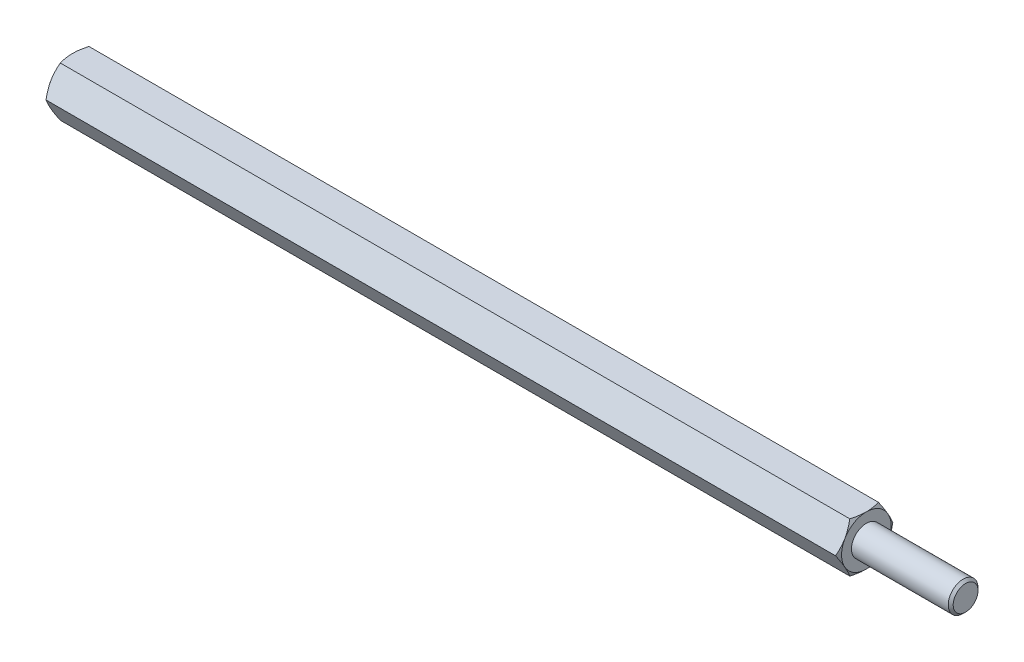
ISO-10303-21;
HEADER;
FILE_DESCRIPTION(('STEP AP214'),'2;1');
FILE_NAME('part.step','',(''),(''),'','','');
FILE_SCHEMA(('AUTOMOTIVE_DESIGN { 1 0 10303 214 1 1 1 1 }'));
ENDSEC;
DATA;
#1=APPLICATION_CONTEXT('core data for automotive mechanical design processes');
#2=APPLICATION_PROTOCOL_DEFINITION('international standard','automotive_design',2000,#1);
#3=PRODUCT_CONTEXT('',#1,'mechanical');
#4=PRODUCT('Part','Part','',(#3));
#5=PRODUCT_RELATED_PRODUCT_CATEGORY('part','',(#4));
#6=PRODUCT_DEFINITION_FORMATION('','',#4);
#7=PRODUCT_DEFINITION_CONTEXT('part definition',#1,'design');
#8=PRODUCT_DEFINITION('design','',#6,#7);
#9=PRODUCT_DEFINITION_SHAPE('','',#8);
#10=(LENGTH_UNIT() NAMED_UNIT(*) SI_UNIT(.MILLI.,.METRE.));
#11=(NAMED_UNIT(*) PLANE_ANGLE_UNIT() SI_UNIT($,.RADIAN.));
#12=(NAMED_UNIT(*) SI_UNIT($,.STERADIAN.) SOLID_ANGLE_UNIT());
#13=UNCERTAINTY_MEASURE_WITH_UNIT(LENGTH_MEASURE(1.E-05),#10,'distance_accuracy_value','');
#14=(GEOMETRIC_REPRESENTATION_CONTEXT(3) GLOBAL_UNCERTAINTY_ASSIGNED_CONTEXT((#13)) GLOBAL_UNIT_ASSIGNED_CONTEXT((#10,
#11,#12)) REPRESENTATION_CONTEXT('',''));
#15=CARTESIAN_POINT('',(0.,0.,0.));
#16=DIRECTION('',(0.,0.,1.));
#17=DIRECTION('',(1.,0.,0.));
#18=AXIS2_PLACEMENT_3D('',#15,#16,#17);
#19=CARTESIAN_POINT('',(40.,2.5,-1.44337567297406));
#20=DIRECTION('',(1.,0.,0.));
#21=DIRECTION('',(0.,0.,-1.));
#22=AXIS2_PLACEMENT_3D('',#19,#20,#21);
#23=PLANE('',#22);
#24=CARTESIAN_POINT('',(40.,0.,0.));
#25=DIRECTION('',(1.,0.,0.));
#26=DIRECTION('',(0.,0.,-1.));
#27=AXIS2_PLACEMENT_3D('',#24,#25,#26);
#28=CIRCLE('',#27,2.50000000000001);
#29=CARTESIAN_POINT('',(40.,-1.25000000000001,-2.16506350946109));
#30=VERTEX_POINT('',#29);
#31=CARTESIAN_POINT('',(40.,1.25,-2.1650635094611));
#32=VERTEX_POINT('',#31);
#33=EDGE_CURVE('E288',#30,#32,#28,.T.);
#34=ORIENTED_EDGE('',*,*,#33,.T.);
#35=CARTESIAN_POINT('',(40.,2.5,0.));
#36=VERTEX_POINT('',#35);
#37=EDGE_CURVE('E53',#32,#36,#28,.T.);
#38=ORIENTED_EDGE('',*,*,#37,.T.);
#39=CARTESIAN_POINT('',(40.,1.25,2.1650635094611));
#40=VERTEX_POINT('',#39);
#41=EDGE_CURVE('E297',#36,#40,#28,.T.);
#42=ORIENTED_EDGE('',*,*,#41,.T.);
#43=CARTESIAN_POINT('',(40.,-1.25000000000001,2.1650635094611));
#44=VERTEX_POINT('',#43);
#45=EDGE_CURVE('E301',#40,#44,#28,.T.);
#46=ORIENTED_EDGE('',*,*,#45,.T.);
#47=CARTESIAN_POINT('',(40.,0.,0.));
#48=DIRECTION('',(-1.,0.,0.));
#49=DIRECTION('',(0.,-1.,0.));
#50=AXIS2_PLACEMENT_3D('',#47,#48,#49);
#51=CIRCLE('',#50,2.50000000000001);
#52=CARTESIAN_POINT('',(40.,-2.50000000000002,0.));
#53=VERTEX_POINT('',#52);
#54=EDGE_CURVE('E193',#53,#44,#51,.T.);
#55=ORIENTED_EDGE('',*,*,#54,.F.);
#56=EDGE_CURVE('E61',#53,#30,#28,.T.);
#57=ORIENTED_EDGE('',*,*,#56,.T.);
#58=EDGE_LOOP('',(#34,#38,#42,#46,#55,#57));
#59=FACE_BOUND('',#58,.T.);
#60=CARTESIAN_POINT('',(40.,0.,0.));
#61=DIRECTION('',(1.,0.,0.));
#62=DIRECTION('',(0.,0.,-1.));
#63=AXIS2_PLACEMENT_3D('',#60,#61,#62);
#64=CIRCLE('',#63,1.5);
#65=CARTESIAN_POINT('',(40.,0.,-1.5));
#66=VERTEX_POINT('',#65);
#67=EDGE_CURVE('E313',#66,#66,#64,.T.);
#68=ORIENTED_EDGE('',*,*,#67,.F.);
#69=EDGE_LOOP('',(#68));
#70=FACE_BOUND('',#69,.T.);
#71=ADVANCED_FACE('F37',(#59,#70),#23,.T.);
#72=CARTESIAN_POINT('',(40.,0.,-2.88675134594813));
#73=DIRECTION('',(0.,-0.5,0.866025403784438));
#74=DIRECTION('',(0.,-0.866025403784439,-0.5));
#75=AXIS2_PLACEMENT_3D('',#72,#73,#74);
#76=PLANE('',#75);
#77=CARTESIAN_POINT('',(39.7766423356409,-0.000200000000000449,-2.88686681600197));
#78=CARTESIAN_POINT('',(39.8132783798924,0.10966323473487,-2.82343724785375));
#79=CARTESIAN_POINT('',(39.846597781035,0.220474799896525,-2.75946016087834));
#80=CARTESIAN_POINT('',(39.9047577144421,0.444016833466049,-2.63039810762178));
#81=CARTESIAN_POINT('',(39.9295776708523,0.556751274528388,-2.5653108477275));
#82=CARTESIAN_POINT('',(39.968214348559,0.780822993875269,-2.43594298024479));
#83=CARTESIAN_POINT('',(39.9822882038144,0.892125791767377,-2.37168227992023));
#84=CARTESIAN_POINT('',(39.9990908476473,1.11525522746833,-2.24285844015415));
#85=CARTESIAN_POINT('',(40.0018335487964,1.22708105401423,-2.17829576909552));
#86=CARTESIAN_POINT('',(39.996134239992,1.43604197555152,-2.05765212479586));
#87=CARTESIAN_POINT('',(39.9890916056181,1.53320831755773,-2.0015531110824));
#88=CARTESIAN_POINT('',(39.9667685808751,1.726907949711,-1.88972057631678));
#89=CARTESIAN_POINT('',(39.9514805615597,1.82344056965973,-1.8339874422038));
#90=CARTESIAN_POINT('',(39.9132609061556,2.01753972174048,-1.7219242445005));
#91=CARTESIAN_POINT('',(39.8901672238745,2.11508168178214,-1.66560836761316));
#92=CARTESIAN_POINT('',(39.8377533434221,2.30871060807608,-1.55381665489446));
#93=CARTESIAN_POINT('',(39.8084454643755,2.40480005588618,-1.49833938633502));
#94=CARTESIAN_POINT('',(39.7766423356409,2.5002,-1.44326020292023));
#95=B_SPLINE_CURVE_WITH_KNOTS('',3,(#77,#78,#79,#80,#81,#82,#83,#84,#85,#86,#87,#88,#89,#90,#91,
#92,#93,#94),.UNSPECIFIED.,.F.,.F.,(4,2,2,2,2,2,2,2,4),(0.,0.396285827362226,0.793524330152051,
1.18093086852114,1.56786160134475,1.90479741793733,2.24204551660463,2.58677531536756,
2.93082800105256),.UNSPECIFIED.);
#96=CARTESIAN_POINT('',(39.7767090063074,0.,-2.88675134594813));
#97=VERTEX_POINT('',#96);
#98=EDGE_CURVE('E353',#97,#32,#95,.T.);
#99=ORIENTED_EDGE('',*,*,#98,.F.);
#100=DIRECTION('',(-1.,0.,0.));
#101=VECTOR('',#100,1.);
#102=CARTESIAN_POINT('',(40.,0.,-2.88675134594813));
#103=LINE('',#102,#101);
#104=CARTESIAN_POINT('',(-39.7767090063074,0.,-2.88675134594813));
#105=VERTEX_POINT('',#104);
#106=EDGE_CURVE('E264',#97,#105,#103,.T.);
#107=ORIENTED_EDGE('',*,*,#106,.T.);
#108=CARTESIAN_POINT('',(-39.7766423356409,2.5002,-1.44326020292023));
#109=CARTESIAN_POINT('',(-39.8132783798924,2.39033676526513,-1.50668977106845));
#110=CARTESIAN_POINT('',(-39.846597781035,2.27952520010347,-1.57066685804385));
#111=CARTESIAN_POINT('',(-39.9047577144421,2.05598316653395,-1.69972891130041));
#112=CARTESIAN_POINT('',(-39.9295776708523,1.94324872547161,-1.7648161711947));
#113=CARTESIAN_POINT('',(-39.968214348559,1.71917700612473,-1.8941840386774));
#114=CARTESIAN_POINT('',(-39.9822882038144,1.60787420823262,-1.95844473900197));
#115=CARTESIAN_POINT('',(-39.9990908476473,1.38474477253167,-2.08726857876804));
#116=CARTESIAN_POINT('',(-40.0018335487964,1.27291894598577,-2.15183124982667));
#117=CARTESIAN_POINT('',(-39.996134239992,1.06395802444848,-2.27247489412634));
#118=CARTESIAN_POINT('',(-39.9890916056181,0.966791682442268,-2.32857390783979));
#119=CARTESIAN_POINT('',(-39.9667685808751,0.773092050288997,-2.44040644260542));
#120=CARTESIAN_POINT('',(-39.9514805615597,0.676559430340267,-2.4961395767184));
#121=CARTESIAN_POINT('',(-39.9132609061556,0.482460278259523,-2.60820277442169));
#122=CARTESIAN_POINT('',(-39.8901672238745,0.384918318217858,-2.66451865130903));
#123=CARTESIAN_POINT('',(-39.8377533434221,0.191289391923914,-2.77631036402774));
#124=CARTESIAN_POINT('',(-39.8084454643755,0.095199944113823,-2.83178763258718));
#125=CARTESIAN_POINT('',(-39.7766423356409,-0.000200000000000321,-2.88686681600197));
#126=B_SPLINE_CURVE_WITH_KNOTS('',3,(#108,#109,#110,#111,#112,#113,#114,#115,#116,#117,#118,
#119,#120,#121,#122,#123,#124,#125),.UNSPECIFIED.,.F.,.F.,(4,2,2,2,2,2,2,2,4),(0.,
0.396285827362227,0.793524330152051,1.18093086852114,1.56786160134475,1.90479741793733,
2.24204551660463,2.58677531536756,2.93082800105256),.UNSPECIFIED.);
#127=CARTESIAN_POINT('',(-40.,1.25,-2.1650635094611));
#128=VERTEX_POINT('',#127);
#129=EDGE_CURVE('E341',#128,#105,#126,.T.);
#130=ORIENTED_EDGE('',*,*,#129,.F.);
#131=CARTESIAN_POINT('',(-39.7767090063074,2.5,-1.44337567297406));
#132=VERTEX_POINT('',#131);
#133=EDGE_CURVE('E393',#132,#128,#126,.T.);
#134=ORIENTED_EDGE('',*,*,#133,.F.);
#135=DIRECTION('',(-1.,0.,0.));
#136=VECTOR('',#135,1.);
#137=CARTESIAN_POINT('',(40.,2.5,-1.44337567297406));
#138=LINE('',#137,#136);
#139=CARTESIAN_POINT('',(39.7767090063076,2.5,-1.44337567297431));
#140=VERTEX_POINT('',#139);
#141=EDGE_CURVE('E279',#140,#132,#138,.T.);
#142=ORIENTED_EDGE('',*,*,#141,.F.);
#143=EDGE_CURVE('E229',#32,#140,#95,.T.);
#144=ORIENTED_EDGE('',*,*,#143,.F.);
#145=EDGE_LOOP('',(#99,#107,#130,#134,#142,#144));
#146=FACE_BOUND('',#145,.T.);
#147=ADVANCED_FACE('F148',(#146),#76,.F.);
#148=CARTESIAN_POINT('',(40.,2.5,-1.44337567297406));
#149=DIRECTION('',(0.,-1.,0.));
#150=DIRECTION('',(0.,0.,-1.));
#151=AXIS2_PLACEMENT_3D('',#148,#149,#150);
#152=PLANE('',#151);
#153=CARTESIAN_POINT('',(38.7680338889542,2.5,-3.90158441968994));
#154=CARTESIAN_POINT('',(38.8212077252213,2.5,-3.79217004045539));
#155=CARTESIAN_POINT('',(38.8738786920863,2.5,-3.68250707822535));
#156=CARTESIAN_POINT('',(38.9779324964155,2.5,-3.46255185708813));
#157=CARTESIAN_POINT('',(39.0293151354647,2.5,-3.35225950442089));
#158=CARTESIAN_POINT('',(39.1307630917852,2.5,-3.13035696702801));
#159=CARTESIAN_POINT('',(39.1808199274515,2.5,-3.0187428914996));
#160=CARTESIAN_POINT('',(39.2789171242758,2.5,-2.79463535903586));
#161=CARTESIAN_POINT('',(39.3269575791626,2.5,-2.6821419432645));
#162=CARTESIAN_POINT('',(39.4220184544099,2.5,-2.45240385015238));
#163=CARTESIAN_POINT('',(39.4689543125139,2.5,-2.33512399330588));
#164=CARTESIAN_POINT('',(39.5593326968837,2.5,-2.09920133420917));
#165=CARTESIAN_POINT('',(39.6027748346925,2.5,-1.98055838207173));
#166=CARTESIAN_POINT('',(39.6850435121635,2.5,-1.74193489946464));
#167=CARTESIAN_POINT('',(39.7238791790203,2.5,-1.62195754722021));
#168=CARTESIAN_POINT('',(39.7957050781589,2.5,-1.38028205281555));
#169=CARTESIAN_POINT('',(39.8286971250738,2.5,-1.25858445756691));
#170=CARTESIAN_POINT('',(39.8870959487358,2.5,-1.01406369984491));
#171=CARTESIAN_POINT('',(39.9125437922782,2.5,-0.891250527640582));
#172=CARTESIAN_POINT('',(39.9544275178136,2.5,-0.64407172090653));
#173=CARTESIAN_POINT('',(39.9708643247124,2.5,-0.519706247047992));
#174=CARTESIAN_POINT('',(39.9932006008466,2.5,-0.271679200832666));
#175=CARTESIAN_POINT('',(39.9992375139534,2.5,-0.148030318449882));
#176=CARTESIAN_POINT('',(40.0006256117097,2.5,0.099339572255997));
#177=CARTESIAN_POINT('',(39.9959765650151,2.5,0.223060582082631));
#178=CARTESIAN_POINT('',(39.9794044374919,2.5,0.432351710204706));
#179=CARTESIAN_POINT('',(39.9701066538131,2.5,0.518143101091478));
#180=CARTESIAN_POINT('',(39.9469384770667,2.5,0.689112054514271));
#181=CARTESIAN_POINT('',(39.9330674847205,2.5,0.774289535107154));
#182=CARTESIAN_POINT('',(39.8853202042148,2.5,1.02876599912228));
#183=CARTESIAN_POINT('',(39.8453176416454,2.5,1.19691958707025));
#184=CARTESIAN_POINT('',(39.7522656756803,2.5,1.53362893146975));
#185=CARTESIAN_POINT('',(39.6989362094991,2.5,1.70210423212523));
#186=CARTESIAN_POINT('',(39.6123716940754,2.5,1.95247339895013));
#187=CARTESIAN_POINT('',(39.5824247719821,2.5,2.0355318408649));
#188=CARTESIAN_POINT('',(39.5206840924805,2.5,2.20095860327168));
#189=CARTESIAN_POINT('',(39.4888903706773,2.5,2.28332693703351));
#190=CARTESIAN_POINT('',(39.404014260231,2.5,2.49723312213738));
#191=CARTESIAN_POINT('',(39.3497173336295,2.5,2.62828796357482));
#192=CARTESIAN_POINT('',(39.2381273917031,2.5,2.88912034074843));
#193=CARTESIAN_POINT('',(39.1808341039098,2.5,3.01889775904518));
#194=CARTESIAN_POINT('',(39.0639348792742,2.5,3.27745045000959));
#195=CARTESIAN_POINT('',(39.004328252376,2.5,3.40622540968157));
#196=CARTESIAN_POINT('',(38.8833234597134,2.5,3.6629323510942));
#197=CARTESIAN_POINT('',(38.821925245,2.5,3.79086430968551));
#198=CARTESIAN_POINT('',(38.6354580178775,2.5,4.17399495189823));
#199=CARTESIAN_POINT('',(38.5082824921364,2.5,4.42816724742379));
#200=CARTESIAN_POINT('',(38.2503455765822,2.5,4.93461464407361));
#201=CARTESIAN_POINT('',(38.1195848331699,2.5,5.18689007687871));
#202=CARTESIAN_POINT('',(37.8687100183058,2.5,5.6651245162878));
#203=CARTESIAN_POINT('',(37.7488298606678,2.5,5.89120644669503));
#204=CARTESIAN_POINT('',(37.5075902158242,2.5,6.34259369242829));
#205=CARTESIAN_POINT('',(37.3862306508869,2.5,6.56789896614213));
#206=CARTESIAN_POINT('',(37.142780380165,2.5,7.01722044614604));
#207=CARTESIAN_POINT('',(37.0206930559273,2.5,7.2412384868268));
#208=CARTESIAN_POINT('',(36.7756662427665,2.5,7.68878772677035));
#209=CARTESIAN_POINT('',(36.652726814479,2.5,7.91231895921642));
#210=CARTESIAN_POINT('',(36.5294756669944,2.5,8.13567697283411));
#211=B_SPLINE_CURVE_WITH_KNOTS('',3,(#153,#154,#155,#156,#157,#158,#159,#160,#161,#162,#163,
#164,#165,#166,#167,#168,#169,#170,#171,#172,#173,#174,#175,#176,#177,#178,#179,#180,#181,#182,
#183,#184,#185,#186,#187,#188,#189,#190,#191,#192,#193,#194,#195,#196,#197,#198,#199,#200,#201,
#202,#203,#204,#205,#206,#207,#208,#209,#210),.UNSPECIFIED.,.F.,.F.,(4,2,2,2,2,2,2,2,2,2,2,2,2,
2,2,2,2,2,2,2,2,2,2,2,2,2,2,2,4),(0.,0.364957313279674,0.729970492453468,1.09692930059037,
1.46387103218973,1.84279746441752,2.22176597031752,2.59997058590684,2.97805755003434,
3.3540469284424,3.72999770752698,4.1009407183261,4.47189175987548,4.73064905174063,
4.98944026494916,5.50729076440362,6.03710483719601,6.30196454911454,6.56681915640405,
6.99233818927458,7.41789598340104,7.84358170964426,8.26927907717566,9.12186602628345,
9.97430025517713,10.7419897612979,11.509719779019,12.2750964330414,13.0404191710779),.UNSPECIFIED.);
#212=EDGE_CURVE('E227',#140,#36,#211,.T.);
#213=ORIENTED_EDGE('',*,*,#212,.F.);
#214=ORIENTED_EDGE('',*,*,#141,.T.);
#215=CARTESIAN_POINT('',(-38.7680338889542,2.5,-3.90158441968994));
#216=CARTESIAN_POINT('',(-38.8212077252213,2.5,-3.79217004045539));
#217=CARTESIAN_POINT('',(-38.8738786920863,2.5,-3.68250707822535));
#218=CARTESIAN_POINT('',(-38.9779324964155,2.5,-3.46255185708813));
#219=CARTESIAN_POINT('',(-39.0293151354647,2.5,-3.35225950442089));
#220=CARTESIAN_POINT('',(-39.1307630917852,2.5,-3.13035696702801));
#221=CARTESIAN_POINT('',(-39.1808199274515,2.5,-3.0187428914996));
#222=CARTESIAN_POINT('',(-39.2789171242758,2.5,-2.79463535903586));
#223=CARTESIAN_POINT('',(-39.3269575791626,2.5,-2.6821419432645));
#224=CARTESIAN_POINT('',(-39.4220184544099,2.5,-2.45240385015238));
#225=CARTESIAN_POINT('',(-39.4689543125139,2.5,-2.33512399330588));
#226=CARTESIAN_POINT('',(-39.5593326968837,2.5,-2.09920133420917));
#227=CARTESIAN_POINT('',(-39.6027748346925,2.5,-1.98055838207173));
#228=CARTESIAN_POINT('',(-39.6850435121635,2.5,-1.74193489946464));
#229=CARTESIAN_POINT('',(-39.7238791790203,2.5,-1.62195754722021));
#230=CARTESIAN_POINT('',(-39.7957050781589,2.5,-1.38028205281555));
#231=CARTESIAN_POINT('',(-39.8286971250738,2.5,-1.25858445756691));
#232=CARTESIAN_POINT('',(-39.8870959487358,2.5,-1.01406369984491));
#233=CARTESIAN_POINT('',(-39.9125437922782,2.5,-0.891250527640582));
#234=CARTESIAN_POINT('',(-39.9544275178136,2.5,-0.64407172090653));
#235=CARTESIAN_POINT('',(-39.9708643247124,2.5,-0.519706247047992));
#236=CARTESIAN_POINT('',(-39.9932006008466,2.5,-0.271679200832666));
#237=CARTESIAN_POINT('',(-39.9992375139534,2.5,-0.148030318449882));
#238=CARTESIAN_POINT('',(-40.0006256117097,2.5,0.099339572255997));
#239=CARTESIAN_POINT('',(-39.9959765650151,2.5,0.223060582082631));
#240=CARTESIAN_POINT('',(-39.9794044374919,2.5,0.432351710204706));
#241=CARTESIAN_POINT('',(-39.9701066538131,2.5,0.518143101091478));
#242=CARTESIAN_POINT('',(-39.9469384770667,2.5,0.689112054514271));
#243=CARTESIAN_POINT('',(-39.9330674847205,2.5,0.774289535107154));
#244=CARTESIAN_POINT('',(-39.8853202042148,2.5,1.02876599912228));
#245=CARTESIAN_POINT('',(-39.8453176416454,2.5,1.19691958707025));
#246=CARTESIAN_POINT('',(-39.7522656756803,2.5,1.53362893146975));
#247=CARTESIAN_POINT('',(-39.6989362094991,2.5,1.70210423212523));
#248=CARTESIAN_POINT('',(-39.6123716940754,2.5,1.95247339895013));
#249=CARTESIAN_POINT('',(-39.5824247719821,2.5,2.0355318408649));
#250=CARTESIAN_POINT('',(-39.5206840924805,2.5,2.20095860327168));
#251=CARTESIAN_POINT('',(-39.4888903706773,2.5,2.28332693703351));
#252=CARTESIAN_POINT('',(-39.404014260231,2.5,2.49723312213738));
#253=CARTESIAN_POINT('',(-39.3497173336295,2.5,2.62828796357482));
#254=CARTESIAN_POINT('',(-39.2381273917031,2.5,2.88912034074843));
#255=CARTESIAN_POINT('',(-39.1808341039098,2.5,3.01889775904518));
#256=CARTESIAN_POINT('',(-39.0639348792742,2.5,3.27745045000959));
#257=CARTESIAN_POINT('',(-39.004328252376,2.5,3.40622540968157));
#258=CARTESIAN_POINT('',(-38.8833234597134,2.5,3.6629323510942));
#259=CARTESIAN_POINT('',(-38.821925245,2.5,3.79086430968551));
#260=CARTESIAN_POINT('',(-38.6354580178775,2.5,4.17399495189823));
#261=CARTESIAN_POINT('',(-38.5082824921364,2.5,4.42816724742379));
#262=CARTESIAN_POINT('',(-38.2503455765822,2.5,4.93461464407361));
#263=CARTESIAN_POINT('',(-38.1195848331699,2.5,5.18689007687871));
#264=CARTESIAN_POINT('',(-37.8687100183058,2.5,5.6651245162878));
#265=CARTESIAN_POINT('',(-37.7488298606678,2.5,5.89120644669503));
#266=CARTESIAN_POINT('',(-37.5075902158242,2.5,6.34259369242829));
#267=CARTESIAN_POINT('',(-37.3862306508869,2.5,6.56789896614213));
#268=CARTESIAN_POINT('',(-37.142780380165,2.5,7.01722044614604));
#269=CARTESIAN_POINT('',(-37.0206930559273,2.5,7.2412384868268));
#270=CARTESIAN_POINT('',(-36.7756662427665,2.5,7.68878772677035));
#271=CARTESIAN_POINT('',(-36.652726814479,2.5,7.91231895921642));
#272=CARTESIAN_POINT('',(-36.5294756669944,2.5,8.13567697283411));
#273=B_SPLINE_CURVE_WITH_KNOTS('',3,(#215,#216,#217,#218,#219,#220,#221,#222,#223,#224,#225,
#226,#227,#228,#229,#230,#231,#232,#233,#234,#235,#236,#237,#238,#239,#240,#241,#242,#243,#244,
#245,#246,#247,#248,#249,#250,#251,#252,#253,#254,#255,#256,#257,#258,#259,#260,#261,#262,#263,
#264,#265,#266,#267,#268,#269,#270,#271,#272),.UNSPECIFIED.,.F.,.F.,(4,2,2,2,2,2,2,2,2,2,2,2,2,
2,2,2,2,2,2,2,2,2,2,2,2,2,2,2,4),(0.,0.364957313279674,0.729970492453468,1.09692930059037,
1.46387103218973,1.84279746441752,2.22176597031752,2.59997058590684,2.97805755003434,
3.3540469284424,3.72999770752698,4.1009407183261,4.47189175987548,4.73064905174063,
4.98944026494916,5.50729076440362,6.03710483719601,6.30196454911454,6.56681915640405,
6.99233818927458,7.41789598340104,7.84358170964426,8.26927907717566,9.12186602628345,
9.97430025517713,10.7419897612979,11.509719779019,12.2750964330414,13.0404191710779),.UNSPECIFIED.);
#274=CARTESIAN_POINT('',(-40.,2.5,0.));
#275=VERTEX_POINT('',#274);
#276=EDGE_CURVE('E241',#275,#132,#273,.F.);
#277=ORIENTED_EDGE('',*,*,#276,.F.);
#278=CARTESIAN_POINT('',(-39.7767090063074,2.5,1.44337567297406));
#279=VERTEX_POINT('',#278);
#280=EDGE_CURVE('E249',#279,#275,#273,.F.);
#281=ORIENTED_EDGE('',*,*,#280,.F.);
#282=DIRECTION('',(-1.,0.,0.));
#283=VECTOR('',#282,1.);
#284=CARTESIAN_POINT('',(40.,2.5,1.44337567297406));
#285=LINE('',#284,#283);
#286=CARTESIAN_POINT('',(39.7767090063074,2.5,1.44337567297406));
#287=VERTEX_POINT('',#286);
#288=EDGE_CURVE('E276',#287,#279,#285,.T.);
#289=ORIENTED_EDGE('',*,*,#288,.F.);
#290=EDGE_CURVE('E221',#36,#287,#211,.T.);
#291=ORIENTED_EDGE('',*,*,#290,.F.);
#292=EDGE_LOOP('',(#213,#214,#277,#281,#289,#291));
#293=FACE_BOUND('',#292,.T.);
#294=ADVANCED_FACE('F153',(#293),#152,.F.);
#295=CARTESIAN_POINT('',(40.,2.5,1.44337567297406));
#296=DIRECTION('',(0.,-0.5,-0.866025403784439));
#297=DIRECTION('',(0.,0.866025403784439,-0.5));
#298=AXIS2_PLACEMENT_3D('',#295,#296,#297);
#299=PLANE('',#298);
#300=CARTESIAN_POINT('',(39.7766423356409,2.5002,1.44326020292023));
#301=CARTESIAN_POINT('',(39.8132783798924,2.39033676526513,1.50668977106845));
#302=CARTESIAN_POINT('',(39.846597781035,2.27952520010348,1.57066685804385));
#303=CARTESIAN_POINT('',(39.9047577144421,2.05598316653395,1.69972891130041));
#304=CARTESIAN_POINT('',(39.9295776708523,1.94324872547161,1.7648161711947));
#305=CARTESIAN_POINT('',(39.968214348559,1.71917700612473,1.8941840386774));
#306=CARTESIAN_POINT('',(39.9822882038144,1.60787420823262,1.95844473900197));
#307=CARTESIAN_POINT('',(39.9990908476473,1.38474477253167,2.08726857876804));
#308=CARTESIAN_POINT('',(40.0018335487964,1.27291894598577,2.15183124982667));
#309=CARTESIAN_POINT('',(39.996134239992,1.06395802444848,2.27247489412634));
#310=CARTESIAN_POINT('',(39.9890916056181,0.966791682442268,2.32857390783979));
#311=CARTESIAN_POINT('',(39.9667685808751,0.773092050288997,2.44040644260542));
#312=CARTESIAN_POINT('',(39.9514805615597,0.676559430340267,2.4961395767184));
#313=CARTESIAN_POINT('',(39.9132609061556,0.482460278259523,2.60820277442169));
#314=CARTESIAN_POINT('',(39.8901672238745,0.384918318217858,2.66451865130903));
#315=CARTESIAN_POINT('',(39.8377533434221,0.191289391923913,2.77631036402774));
#316=CARTESIAN_POINT('',(39.8084454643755,0.0951999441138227,2.83178763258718));
#317=CARTESIAN_POINT('',(39.7766423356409,-0.000200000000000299,2.88686681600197));
#318=B_SPLINE_CURVE_WITH_KNOTS('',3,(#300,#301,#302,#303,#304,#305,#306,#307,#308,#309,#310,
#311,#312,#313,#314,#315,#316,#317),.UNSPECIFIED.,.F.,.F.,(4,2,2,2,2,2,2,2,4),(0.,
0.396285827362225,0.793524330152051,1.18093086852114,1.56786160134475,1.90479741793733,
2.24204551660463,2.58677531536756,2.93082800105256),.UNSPECIFIED.);
#319=EDGE_CURVE('E228',#287,#40,#318,.T.);
#320=ORIENTED_EDGE('',*,*,#319,.F.);
#321=ORIENTED_EDGE('',*,*,#288,.T.);
#322=CARTESIAN_POINT('',(-39.7766423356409,-0.00020000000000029,2.88686681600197));
#323=CARTESIAN_POINT('',(-39.8132783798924,0.10966323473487,2.82343724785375));
#324=CARTESIAN_POINT('',(-39.846597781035,0.220474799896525,2.75946016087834));
#325=CARTESIAN_POINT('',(-39.9047577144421,0.444016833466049,2.63039810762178));
#326=CARTESIAN_POINT('',(-39.9295776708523,0.556751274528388,2.5653108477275));
#327=CARTESIAN_POINT('',(-39.968214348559,0.780822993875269,2.43594298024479));
#328=CARTESIAN_POINT('',(-39.9822882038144,0.892125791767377,2.37168227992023));
#329=CARTESIAN_POINT('',(-39.9990908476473,1.11525522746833,2.24285844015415));
#330=CARTESIAN_POINT('',(-40.0018335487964,1.22708105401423,2.17829576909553));
#331=CARTESIAN_POINT('',(-39.996134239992,1.43604197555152,2.05765212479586));
#332=CARTESIAN_POINT('',(-39.9890916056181,1.53320831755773,2.0015531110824));
#333=CARTESIAN_POINT('',(-39.9667685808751,1.726907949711,1.88972057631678));
#334=CARTESIAN_POINT('',(-39.9514805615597,1.82344056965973,1.8339874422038));
#335=CARTESIAN_POINT('',(-39.9132609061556,2.01753972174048,1.7219242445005));
#336=CARTESIAN_POINT('',(-39.8901672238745,2.11508168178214,1.66560836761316));
#337=CARTESIAN_POINT('',(-39.8377533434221,2.30871060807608,1.55381665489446));
#338=CARTESIAN_POINT('',(-39.8084454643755,2.40480005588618,1.49833938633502));
#339=CARTESIAN_POINT('',(-39.7766423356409,2.5002,1.44326020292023));
#340=B_SPLINE_CURVE_WITH_KNOTS('',3,(#322,#323,#324,#325,#326,#327,#328,#329,#330,#331,#332,
#333,#334,#335,#336,#337,#338,#339),.UNSPECIFIED.,.F.,.F.,(4,2,2,2,2,2,2,2,4),(0.,
0.396285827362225,0.793524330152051,1.18093086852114,1.56786160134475,1.90479741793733,
2.24204551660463,2.58677531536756,2.93082800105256),.UNSPECIFIED.);
#341=CARTESIAN_POINT('',(-40.,1.25,2.1650635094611));
#342=VERTEX_POINT('',#341);
#343=EDGE_CURVE('E255',#342,#279,#340,.T.);
#344=ORIENTED_EDGE('',*,*,#343,.F.);
#345=CARTESIAN_POINT('',(-39.7767090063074,0.,2.88675134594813));
#346=VERTEX_POINT('',#345);
#347=EDGE_CURVE('E262',#346,#342,#340,.T.);
#348=ORIENTED_EDGE('',*,*,#347,.F.);
#349=DIRECTION('',(-1.,0.,0.));
#350=VECTOR('',#349,1.);
#351=CARTESIAN_POINT('',(40.,0.,2.88675134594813));
#352=LINE('',#351,#350);
#353=CARTESIAN_POINT('',(39.7767090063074,0.,2.88675134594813));
#354=VERTEX_POINT('',#353);
#355=EDGE_CURVE('E273',#354,#346,#352,.T.);
#356=ORIENTED_EDGE('',*,*,#355,.F.);
#357=EDGE_CURVE('E215',#40,#354,#318,.T.);
#358=ORIENTED_EDGE('',*,*,#357,.F.);
#359=EDGE_LOOP('',(#320,#321,#344,#348,#356,#358));
#360=FACE_BOUND('',#359,.T.);
#361=ADVANCED_FACE('F235',(#360),#299,.F.);
#362=CARTESIAN_POINT('',(40.,0.,2.88675134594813));
#363=DIRECTION('',(0.,0.5,-0.866025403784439));
#364=DIRECTION('',(0.,0.866025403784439,0.5));
#365=AXIS2_PLACEMENT_3D('',#362,#363,#364);
#366=PLANE('',#365);
#367=CARTESIAN_POINT('',(39.7766423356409,0.000200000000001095,2.88686681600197));
#368=CARTESIAN_POINT('',(39.8132783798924,-0.10966323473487,2.82343724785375));
#369=CARTESIAN_POINT('',(39.846597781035,-0.220474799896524,2.75946016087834));
#370=CARTESIAN_POINT('',(39.9047577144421,-0.444016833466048,2.63039810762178));
#371=CARTESIAN_POINT('',(39.9295776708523,-0.556751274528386,2.5653108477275));
#372=CARTESIAN_POINT('',(39.968214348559,-0.780822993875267,2.43594298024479));
#373=CARTESIAN_POINT('',(39.9822882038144,-0.892125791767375,2.37168227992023));
#374=CARTESIAN_POINT('',(39.9990908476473,-1.11525522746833,2.24285844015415));
#375=CARTESIAN_POINT('',(40.0018335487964,-1.22708105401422,2.17829576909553));
#376=CARTESIAN_POINT('',(39.996134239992,-1.43604197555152,2.05765212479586));
#377=CARTESIAN_POINT('',(39.9890916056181,-1.53320831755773,2.0015531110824));
#378=CARTESIAN_POINT('',(39.9667685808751,-1.726907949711,1.88972057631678));
#379=CARTESIAN_POINT('',(39.9514805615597,-1.82344056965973,1.8339874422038));
#380=CARTESIAN_POINT('',(39.9132609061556,-2.01753972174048,1.7219242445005));
#381=CARTESIAN_POINT('',(39.8901672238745,-2.11508168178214,1.66560836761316));
#382=CARTESIAN_POINT('',(39.8377533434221,-2.30871060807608,1.55381665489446));
#383=CARTESIAN_POINT('',(39.8084454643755,-2.40480005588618,1.49833938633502));
#384=CARTESIAN_POINT('',(39.7766423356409,-2.5002,1.44326020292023));
#385=B_SPLINE_CURVE_WITH_KNOTS('',3,(#367,#368,#369,#370,#371,#372,#373,#374,#375,#376,#377,
#378,#379,#380,#381,#382,#383,#384),.UNSPECIFIED.,.F.,.F.,(4,2,2,2,2,2,2,2,4),(0.,
0.396285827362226,0.793524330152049,1.18093086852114,1.56786160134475,1.90479741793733,
2.24204551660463,2.58677531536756,2.93082800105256),.UNSPECIFIED.);
#386=EDGE_CURVE('E374',#354,#44,#385,.T.);
#387=ORIENTED_EDGE('',*,*,#386,.F.);
#388=ORIENTED_EDGE('',*,*,#355,.T.);
#389=CARTESIAN_POINT('',(-39.7766423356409,-2.5002,1.44326020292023));
#390=CARTESIAN_POINT('',(-39.8132783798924,-2.39033676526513,1.50668977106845));
#391=CARTESIAN_POINT('',(-39.846597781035,-2.27952520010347,1.57066685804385));
#392=CARTESIAN_POINT('',(-39.9047577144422,-2.05598316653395,1.69972891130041));
#393=CARTESIAN_POINT('',(-39.9295776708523,-1.94324872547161,1.7648161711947));
#394=CARTESIAN_POINT('',(-39.968214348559,-1.71917700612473,1.8941840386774));
#395=CARTESIAN_POINT('',(-39.9822882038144,-1.60787420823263,1.95844473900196));
#396=CARTESIAN_POINT('',(-39.9990908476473,-1.38474477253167,2.08726857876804));
#397=CARTESIAN_POINT('',(-40.0018335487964,-1.27291894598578,2.15183124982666));
#398=CARTESIAN_POINT('',(-39.996134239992,-1.06395802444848,2.27247489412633));
#399=CARTESIAN_POINT('',(-39.9890916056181,-0.966791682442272,2.32857390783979));
#400=CARTESIAN_POINT('',(-39.9667685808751,-0.773092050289,2.44040644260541));
#401=CARTESIAN_POINT('',(-39.9514805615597,-0.676559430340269,2.49613957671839));
#402=CARTESIAN_POINT('',(-39.9132609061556,-0.482460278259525,2.60820277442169));
#403=CARTESIAN_POINT('',(-39.8901672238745,-0.384918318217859,2.66451865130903));
#404=CARTESIAN_POINT('',(-39.8377533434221,-0.191289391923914,2.77631036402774));
#405=CARTESIAN_POINT('',(-39.8084454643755,-0.0951999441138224,2.83178763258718));
#406=CARTESIAN_POINT('',(-39.7766423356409,0.000200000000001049,2.88686681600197));
#407=B_SPLINE_CURVE_WITH_KNOTS('',3,(#389,#390,#391,#392,#393,#394,#395,#396,#397,#398,#399,
#400,#401,#402,#403,#404,#405,#406),.UNSPECIFIED.,.F.,.F.,(4,2,2,2,2,2,2,2,4),(0.,
0.396285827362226,0.793524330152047,1.18093086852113,1.56786160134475,1.90479741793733,
2.24204551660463,2.58677531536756,2.93082800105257),.UNSPECIFIED.);
#408=CARTESIAN_POINT('',(-40.,-1.25000000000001,2.1650635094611));
#409=VERTEX_POINT('',#408);
#410=EDGE_CURVE('E263',#409,#346,#407,.T.);
#411=ORIENTED_EDGE('',*,*,#410,.F.);
#412=CARTESIAN_POINT('',(-39.7767090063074,-2.5,1.44337567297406));
#413=VERTEX_POINT('',#412);
#414=EDGE_CURVE('E250',#413,#409,#407,.T.);
#415=ORIENTED_EDGE('',*,*,#414,.F.);
#416=DIRECTION('',(-1.,0.,0.));
#417=VECTOR('',#416,1.);
#418=CARTESIAN_POINT('',(40.,-2.5,1.44337567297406));
#419=LINE('',#418,#417);
#420=CARTESIAN_POINT('',(39.7767090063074,-2.5,1.44337567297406));
#421=VERTEX_POINT('',#420);
#422=EDGE_CURVE('E270',#421,#413,#419,.T.);
#423=ORIENTED_EDGE('',*,*,#422,.F.);
#424=EDGE_CURVE('E210',#44,#421,#385,.T.);
#425=ORIENTED_EDGE('',*,*,#424,.F.);
#426=EDGE_LOOP('',(#387,#388,#411,#415,#423,#425));
#427=FACE_BOUND('',#426,.T.);
#428=ADVANCED_FACE('F442',(#427),#366,.F.);
#429=CARTESIAN_POINT('',(40.,-2.5,1.44337567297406));
#430=DIRECTION('',(0.,1.,0.));
#431=DIRECTION('',(0.,0.,1.));
#432=AXIS2_PLACEMENT_3D('',#429,#430,#431);
#433=PLANE('',#432);
#434=CARTESIAN_POINT('',(38.7680338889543,-2.5,-3.90158441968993));
#435=CARTESIAN_POINT('',(38.8212077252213,-2.5,-3.79217004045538));
#436=CARTESIAN_POINT('',(38.8738786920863,-2.5,-3.68250707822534));
#437=CARTESIAN_POINT('',(38.9779324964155,-2.5,-3.46255185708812));
#438=CARTESIAN_POINT('',(39.0293151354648,-2.5,-3.35225950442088));
#439=CARTESIAN_POINT('',(39.1307630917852,-2.5,-3.130356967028));
#440=CARTESIAN_POINT('',(39.1808199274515,-2.5,-3.01874289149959));
#441=CARTESIAN_POINT('',(39.2789171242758,-2.5,-2.79463535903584));
#442=CARTESIAN_POINT('',(39.3269575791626,-2.5,-2.68214194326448));
#443=CARTESIAN_POINT('',(39.4220184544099,-2.5,-2.45240385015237));
#444=CARTESIAN_POINT('',(39.4689543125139,-2.5,-2.33512399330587));
#445=CARTESIAN_POINT('',(39.5593326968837,-2.5,-2.09920133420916));
#446=CARTESIAN_POINT('',(39.6027748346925,-2.5,-1.98055838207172));
#447=CARTESIAN_POINT('',(39.6850435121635,-2.5,-1.74193489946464));
#448=CARTESIAN_POINT('',(39.7238791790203,-2.5,-1.6219575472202));
#449=CARTESIAN_POINT('',(39.7957050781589,-2.5,-1.38028205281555));
#450=CARTESIAN_POINT('',(39.8286971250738,-2.5,-1.25858445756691));
#451=CARTESIAN_POINT('',(39.8870959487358,-2.5,-1.01406369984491));
#452=CARTESIAN_POINT('',(39.9125437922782,-2.5,-0.891250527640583));
#453=CARTESIAN_POINT('',(39.9544275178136,-2.5,-0.644071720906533));
#454=CARTESIAN_POINT('',(39.9708643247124,-2.5,-0.519706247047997));
#455=CARTESIAN_POINT('',(39.9932006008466,-2.5,-0.271679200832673));
#456=CARTESIAN_POINT('',(39.9992375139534,-2.5,-0.148030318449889));
#457=CARTESIAN_POINT('',(40.0006256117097,-2.5,0.099339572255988));
#458=CARTESIAN_POINT('',(39.9959765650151,-2.5,0.223060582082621));
#459=CARTESIAN_POINT('',(39.979404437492,-2.5,0.432351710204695));
#460=CARTESIAN_POINT('',(39.9701066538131,-2.5,0.518143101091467));
#461=CARTESIAN_POINT('',(39.9469384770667,-2.5,0.68911205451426));
#462=CARTESIAN_POINT('',(39.9330674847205,-2.5,0.774289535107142));
#463=CARTESIAN_POINT('',(39.8853202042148,-2.5,1.02876599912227));
#464=CARTESIAN_POINT('',(39.8453176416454,-2.5,1.19691958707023));
#465=CARTESIAN_POINT('',(39.7522656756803,-2.5,1.53362893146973));
#466=CARTESIAN_POINT('',(39.6989362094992,-2.5,1.7021042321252));
#467=CARTESIAN_POINT('',(39.6123716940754,-2.5,1.9524733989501));
#468=CARTESIAN_POINT('',(39.5824247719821,-2.5,2.03553184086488));
#469=CARTESIAN_POINT('',(39.5206840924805,-2.5,2.20095860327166));
#470=CARTESIAN_POINT('',(39.4888903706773,-2.5,2.28332693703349));
#471=CARTESIAN_POINT('',(39.404014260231,-2.5,2.49723312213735));
#472=CARTESIAN_POINT('',(39.3497173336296,-2.5,2.62828796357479));
#473=CARTESIAN_POINT('',(39.2381273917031,-2.5,2.8891203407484));
#474=CARTESIAN_POINT('',(39.1808341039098,-2.5,3.01889775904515));
#475=CARTESIAN_POINT('',(39.0639348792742,-2.5,3.27745045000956));
#476=CARTESIAN_POINT('',(39.004328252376,-2.5,3.40622540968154));
#477=CARTESIAN_POINT('',(38.8833234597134,-2.5,3.66293235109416));
#478=CARTESIAN_POINT('',(38.821925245,-2.5,3.79086430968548));
#479=CARTESIAN_POINT('',(38.6354580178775,-2.5,4.1739949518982));
#480=CARTESIAN_POINT('',(38.5082824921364,-2.5,4.42816724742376));
#481=CARTESIAN_POINT('',(38.2503455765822,-2.5,4.93461464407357));
#482=CARTESIAN_POINT('',(38.1195848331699,-2.5,5.18689007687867));
#483=CARTESIAN_POINT('',(37.8687100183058,-2.5,5.66512451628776));
#484=CARTESIAN_POINT('',(37.7488298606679,-2.5,5.891206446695));
#485=CARTESIAN_POINT('',(37.5075902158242,-2.5,6.34259369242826));
#486=CARTESIAN_POINT('',(37.3862306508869,-2.5,6.56789896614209));
#487=CARTESIAN_POINT('',(37.142780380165,-2.5,7.01722044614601));
#488=CARTESIAN_POINT('',(37.0206930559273,-2.5,7.24123848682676));
#489=CARTESIAN_POINT('',(36.7756662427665,-2.5,7.68878772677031));
#490=CARTESIAN_POINT('',(36.652726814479,-2.5,7.91231895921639));
#491=CARTESIAN_POINT('',(36.5294756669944,-2.5,8.13567697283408));
#492=B_SPLINE_CURVE_WITH_KNOTS('',3,(#434,#435,#436,#437,#438,#439,#440,#441,#442,#443,#444,
#445,#446,#447,#448,#449,#450,#451,#452,#453,#454,#455,#456,#457,#458,#459,#460,#461,#462,#463,
#464,#465,#466,#467,#468,#469,#470,#471,#472,#473,#474,#475,#476,#477,#478,#479,#480,#481,#482,
#483,#484,#485,#486,#487,#488,#489,#490,#491),.UNSPECIFIED.,.F.,.F.,(4,2,2,2,2,2,2,2,2,2,2,2,2,
2,2,2,2,2,2,2,2,2,2,2,2,2,2,2,4),(0.,0.364957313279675,0.729970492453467,1.09692930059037,
1.46387103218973,1.84279746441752,2.22176597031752,2.59997058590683,2.97805755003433,
3.35404692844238,3.72999770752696,4.10094071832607,4.47189175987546,4.73064905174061,
4.98944026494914,5.50729076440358,6.03710483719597,6.3019645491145,6.566819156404,
6.99233818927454,7.41789598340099,7.84358170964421,8.26927907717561,9.12186602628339,
9.97430025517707,10.7419897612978,11.5097197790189,12.2750964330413,13.0404191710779),.UNSPECIFIED.);
#493=EDGE_CURVE('E381',#421,#53,#492,.F.);
#494=ORIENTED_EDGE('',*,*,#493,.F.);
#495=ORIENTED_EDGE('',*,*,#422,.T.);
#496=CARTESIAN_POINT('',(-38.7680338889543,-2.5,-3.90158441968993));
#497=CARTESIAN_POINT('',(-38.8212077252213,-2.5,-3.79217004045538));
#498=CARTESIAN_POINT('',(-38.8738786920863,-2.5,-3.68250707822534));
#499=CARTESIAN_POINT('',(-38.9779324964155,-2.5,-3.46255185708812));
#500=CARTESIAN_POINT('',(-39.0293151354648,-2.5,-3.35225950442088));
#501=CARTESIAN_POINT('',(-39.1307630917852,-2.5,-3.130356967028));
#502=CARTESIAN_POINT('',(-39.1808199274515,-2.5,-3.01874289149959));
#503=CARTESIAN_POINT('',(-39.2789171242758,-2.5,-2.79463535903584));
#504=CARTESIAN_POINT('',(-39.3269575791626,-2.5,-2.68214194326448));
#505=CARTESIAN_POINT('',(-39.4220184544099,-2.5,-2.45240385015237));
#506=CARTESIAN_POINT('',(-39.4689543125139,-2.5,-2.33512399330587));
#507=CARTESIAN_POINT('',(-39.5593326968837,-2.5,-2.09920133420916));
#508=CARTESIAN_POINT('',(-39.6027748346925,-2.5,-1.98055838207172));
#509=CARTESIAN_POINT('',(-39.6850435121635,-2.5,-1.74193489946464));
#510=CARTESIAN_POINT('',(-39.7238791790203,-2.5,-1.6219575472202));
#511=CARTESIAN_POINT('',(-39.7957050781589,-2.5,-1.38028205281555));
#512=CARTESIAN_POINT('',(-39.8286971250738,-2.5,-1.25858445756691));
#513=CARTESIAN_POINT('',(-39.8870959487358,-2.5,-1.01406369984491));
#514=CARTESIAN_POINT('',(-39.9125437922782,-2.5,-0.891250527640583));
#515=CARTESIAN_POINT('',(-39.9544275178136,-2.5,-0.644071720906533));
#516=CARTESIAN_POINT('',(-39.9708643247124,-2.5,-0.519706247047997));
#517=CARTESIAN_POINT('',(-39.9932006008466,-2.5,-0.271679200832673));
#518=CARTESIAN_POINT('',(-39.9992375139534,-2.5,-0.148030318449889));
#519=CARTESIAN_POINT('',(-40.0006256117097,-2.5,0.099339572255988));
#520=CARTESIAN_POINT('',(-39.9959765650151,-2.5,0.223060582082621));
#521=CARTESIAN_POINT('',(-39.979404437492,-2.5,0.432351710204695));
#522=CARTESIAN_POINT('',(-39.9701066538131,-2.5,0.518143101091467));
#523=CARTESIAN_POINT('',(-39.9469384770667,-2.5,0.68911205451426));
#524=CARTESIAN_POINT('',(-39.9330674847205,-2.5,0.774289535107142));
#525=CARTESIAN_POINT('',(-39.8853202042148,-2.5,1.02876599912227));
#526=CARTESIAN_POINT('',(-39.8453176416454,-2.5,1.19691958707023));
#527=CARTESIAN_POINT('',(-39.7522656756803,-2.5,1.53362893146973));
#528=CARTESIAN_POINT('',(-39.6989362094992,-2.5,1.7021042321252));
#529=CARTESIAN_POINT('',(-39.6123716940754,-2.5,1.9524733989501));
#530=CARTESIAN_POINT('',(-39.5824247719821,-2.5,2.03553184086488));
#531=CARTESIAN_POINT('',(-39.5206840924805,-2.5,2.20095860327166));
#532=CARTESIAN_POINT('',(-39.4888903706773,-2.5,2.28332693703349));
#533=CARTESIAN_POINT('',(-39.404014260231,-2.5,2.49723312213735));
#534=CARTESIAN_POINT('',(-39.3497173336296,-2.5,2.62828796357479));
#535=CARTESIAN_POINT('',(-39.2381273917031,-2.5,2.8891203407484));
#536=CARTESIAN_POINT('',(-39.1808341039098,-2.5,3.01889775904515));
#537=CARTESIAN_POINT('',(-39.0639348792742,-2.5,3.27745045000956));
#538=CARTESIAN_POINT('',(-39.004328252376,-2.5,3.40622540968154));
#539=CARTESIAN_POINT('',(-38.8833234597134,-2.5,3.66293235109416));
#540=CARTESIAN_POINT('',(-38.821925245,-2.5,3.79086430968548));
#541=CARTESIAN_POINT('',(-38.6354580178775,-2.5,4.1739949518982));
#542=CARTESIAN_POINT('',(-38.5082824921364,-2.5,4.42816724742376));
#543=CARTESIAN_POINT('',(-38.2503455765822,-2.5,4.93461464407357));
#544=CARTESIAN_POINT('',(-38.1195848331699,-2.5,5.18689007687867));
#545=CARTESIAN_POINT('',(-37.8687100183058,-2.5,5.66512451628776));
#546=CARTESIAN_POINT('',(-37.7488298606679,-2.5,5.891206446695));
#547=CARTESIAN_POINT('',(-37.5075902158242,-2.5,6.34259369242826));
#548=CARTESIAN_POINT('',(-37.3862306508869,-2.5,6.56789896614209));
#549=CARTESIAN_POINT('',(-37.142780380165,-2.5,7.01722044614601));
#550=CARTESIAN_POINT('',(-37.0206930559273,-2.5,7.24123848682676));
#551=CARTESIAN_POINT('',(-36.7756662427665,-2.5,7.68878772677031));
#552=CARTESIAN_POINT('',(-36.652726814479,-2.5,7.91231895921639));
#553=CARTESIAN_POINT('',(-36.5294756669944,-2.5,8.13567697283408));
#554=B_SPLINE_CURVE_WITH_KNOTS('',3,(#496,#497,#498,#499,#500,#501,#502,#503,#504,#505,#506,
#507,#508,#509,#510,#511,#512,#513,#514,#515,#516,#517,#518,#519,#520,#521,#522,#523,#524,#525,
#526,#527,#528,#529,#530,#531,#532,#533,#534,#535,#536,#537,#538,#539,#540,#541,#542,#543,#544,
#545,#546,#547,#548,#549,#550,#551,#552,#553),.UNSPECIFIED.,.F.,.F.,(4,2,2,2,2,2,2,2,2,2,2,2,2,
2,2,2,2,2,2,2,2,2,2,2,2,2,2,2,4),(0.,0.364957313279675,0.729970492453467,1.09692930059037,
1.46387103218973,1.84279746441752,2.22176597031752,2.59997058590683,2.97805755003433,
3.35404692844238,3.72999770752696,4.10094071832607,4.47189175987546,4.73064905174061,
4.98944026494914,5.50729076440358,6.03710483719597,6.3019645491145,6.566819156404,
6.99233818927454,7.41789598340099,7.84358170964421,8.26927907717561,9.12186602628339,
9.97430025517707,10.7419897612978,11.5097197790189,12.2750964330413,13.0404191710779),.UNSPECIFIED.);
#555=CARTESIAN_POINT('',(-40.,-2.50000000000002,0.));
#556=VERTEX_POINT('',#555);
#557=EDGE_CURVE('E342',#556,#413,#554,.T.);
#558=ORIENTED_EDGE('',*,*,#557,.F.);
#559=CARTESIAN_POINT('',(-39.7767090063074,-2.5,-1.44337567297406));
#560=VERTEX_POINT('',#559);
#561=EDGE_CURVE('E335',#560,#556,#554,.T.);
#562=ORIENTED_EDGE('',*,*,#561,.F.);
#563=DIRECTION('',(-1.,0.,0.));
#564=VECTOR('',#563,1.);
#565=CARTESIAN_POINT('',(40.,-2.5,-1.44337567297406));
#566=LINE('',#565,#564);
#567=CARTESIAN_POINT('',(39.7767090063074,-2.5,-1.44337567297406));
#568=VERTEX_POINT('',#567);
#569=EDGE_CURVE('E267',#568,#560,#566,.T.);
#570=ORIENTED_EDGE('',*,*,#569,.F.);
#571=EDGE_CURVE('E195',#53,#568,#492,.F.);
#572=ORIENTED_EDGE('',*,*,#571,.F.);
#573=EDGE_LOOP('',(#494,#495,#558,#562,#570,#572));
#574=FACE_BOUND('',#573,.T.);
#575=ADVANCED_FACE('F172',(#574),#433,.F.);
#576=CARTESIAN_POINT('',(40.,-2.5,-1.44337567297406));
#577=DIRECTION('',(0.,0.5,0.866025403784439));
#578=DIRECTION('',(0.,-0.866025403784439,0.5));
#579=AXIS2_PLACEMENT_3D('',#576,#577,#578);
#580=PLANE('',#579);
#581=CARTESIAN_POINT('',(39.7766423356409,-2.5002,-1.44326020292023));
#582=CARTESIAN_POINT('',(39.8132783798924,-2.39033676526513,-1.50668977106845));
#583=CARTESIAN_POINT('',(39.846597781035,-2.27952520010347,-1.57066685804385));
#584=CARTESIAN_POINT('',(39.9047577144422,-2.05598316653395,-1.69972891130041));
#585=CARTESIAN_POINT('',(39.9295776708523,-1.94324872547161,-1.7648161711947));
#586=CARTESIAN_POINT('',(39.968214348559,-1.71917700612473,-1.8941840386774));
#587=CARTESIAN_POINT('',(39.9822882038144,-1.60787420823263,-1.95844473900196));
#588=CARTESIAN_POINT('',(39.9990908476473,-1.38474477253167,-2.08726857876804));
#589=CARTESIAN_POINT('',(40.0018335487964,-1.27291894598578,-2.15183124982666));
#590=CARTESIAN_POINT('',(39.996134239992,-1.06395802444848,-2.27247489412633));
#591=CARTESIAN_POINT('',(39.9890916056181,-0.966791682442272,-2.32857390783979));
#592=CARTESIAN_POINT('',(39.9667685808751,-0.773092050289,-2.44040644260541));
#593=CARTESIAN_POINT('',(39.9514805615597,-0.67655943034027,-2.49613957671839));
#594=CARTESIAN_POINT('',(39.9132609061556,-0.482460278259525,-2.60820277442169));
#595=CARTESIAN_POINT('',(39.8901672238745,-0.38491831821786,-2.66451865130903));
#596=CARTESIAN_POINT('',(39.8377533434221,-0.191289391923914,-2.77631036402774));
#597=CARTESIAN_POINT('',(39.8084454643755,-0.0951999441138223,-2.83178763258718));
#598=CARTESIAN_POINT('',(39.7766423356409,0.000200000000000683,-2.88686681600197));
#599=B_SPLINE_CURVE_WITH_KNOTS('',3,(#581,#582,#583,#584,#585,#586,#587,#588,#589,#590,#591,
#592,#593,#594,#595,#596,#597,#598),.UNSPECIFIED.,.F.,.F.,(4,2,2,2,2,2,2,2,4),(0.,
0.396285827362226,0.793524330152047,1.18093086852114,1.56786160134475,1.90479741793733,
2.24204551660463,2.58677531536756,2.93082800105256),.UNSPECIFIED.);
#600=EDGE_CURVE('E192',#568,#30,#599,.T.);
#601=ORIENTED_EDGE('',*,*,#600,.F.);
#602=ORIENTED_EDGE('',*,*,#569,.T.);
#603=CARTESIAN_POINT('',(-39.7766423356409,0.000200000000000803,-2.88686681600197));
#604=CARTESIAN_POINT('',(-39.8132783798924,-0.10966323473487,-2.82343724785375));
#605=CARTESIAN_POINT('',(-39.846597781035,-0.220474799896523,-2.75946016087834));
#606=CARTESIAN_POINT('',(-39.9047577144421,-0.444016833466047,-2.63039810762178));
#607=CARTESIAN_POINT('',(-39.9295776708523,-0.556751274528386,-2.5653108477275));
#608=CARTESIAN_POINT('',(-39.968214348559,-0.780822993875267,-2.43594298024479));
#609=CARTESIAN_POINT('',(-39.9822882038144,-0.892125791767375,-2.37168227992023));
#610=CARTESIAN_POINT('',(-39.9990908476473,-1.11525522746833,-2.24285844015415));
#611=CARTESIAN_POINT('',(-40.0018335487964,-1.22708105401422,-2.17829576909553));
#612=CARTESIAN_POINT('',(-39.996134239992,-1.43604197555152,-2.05765212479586));
#613=CARTESIAN_POINT('',(-39.9890916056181,-1.53320831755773,-2.0015531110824));
#614=CARTESIAN_POINT('',(-39.9667685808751,-1.726907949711,-1.88972057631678));
#615=CARTESIAN_POINT('',(-39.9514805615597,-1.82344056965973,-1.8339874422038));
#616=CARTESIAN_POINT('',(-39.9132609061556,-2.01753972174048,-1.7219242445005));
#617=CARTESIAN_POINT('',(-39.8901672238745,-2.11508168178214,-1.66560836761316));
#618=CARTESIAN_POINT('',(-39.8377533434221,-2.30871060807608,-1.55381665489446));
#619=CARTESIAN_POINT('',(-39.8084454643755,-2.40480005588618,-1.49833938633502));
#620=CARTESIAN_POINT('',(-39.7766423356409,-2.5002,-1.44326020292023));
#621=B_SPLINE_CURVE_WITH_KNOTS('',3,(#603,#604,#605,#606,#607,#608,#609,#610,#611,#612,#613,
#614,#615,#616,#617,#618,#619,#620),.UNSPECIFIED.,.F.,.F.,(4,2,2,2,2,2,2,2,4),(0.,
0.396285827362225,0.793524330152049,1.18093086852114,1.56786160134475,1.90479741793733,
2.24204551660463,2.58677531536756,2.93082800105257),.UNSPECIFIED.);
#622=CARTESIAN_POINT('',(-40.,-1.25000000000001,-2.16506350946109));
#623=VERTEX_POINT('',#622);
#624=EDGE_CURVE('E178',#623,#560,#621,.T.);
#625=ORIENTED_EDGE('',*,*,#624,.F.);
#626=EDGE_CURVE('E333',#105,#623,#621,.T.);
#627=ORIENTED_EDGE('',*,*,#626,.F.);
#628=ORIENTED_EDGE('',*,*,#106,.F.);
#629=EDGE_CURVE('E185',#30,#97,#599,.T.);
#630=ORIENTED_EDGE('',*,*,#629,.F.);
#631=EDGE_LOOP('',(#601,#602,#625,#627,#628,#630));
#632=FACE_BOUND('',#631,.T.);
#633=ADVANCED_FACE('F167',(#632),#580,.F.);
#634=CARTESIAN_POINT('',(-40.,0.,0.));
#635=DIRECTION('',(1.,0.,0.));
#636=DIRECTION('',(0.,1.,0.));
#637=AXIS2_PLACEMENT_3D('',#634,#635,#636);
#638=CONICAL_SURFACE('',#637,2.50000000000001,1.0471975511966);
#639=ORIENTED_EDGE('',*,*,#129,.T.);
#640=ORIENTED_EDGE('',*,*,#626,.T.);
#641=CARTESIAN_POINT('',(-40.,0.,0.));
#642=DIRECTION('',(1.,0.,0.));
#643=DIRECTION('',(0.,0.,-1.));
#644=AXIS2_PLACEMENT_3D('',#641,#642,#643);
#645=CIRCLE('',#644,2.50000000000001);
#646=EDGE_CURVE('E282',#623,#128,#645,.T.);
#647=ORIENTED_EDGE('',*,*,#646,.T.);
#648=EDGE_LOOP('',(#639,#640,#647));
#649=FACE_BOUND('',#648,.T.);
#650=ADVANCED_FACE('F171',(#649),#638,.T.);
#651=ORIENTED_EDGE('',*,*,#561,.T.);
#652=EDGE_CURVE('E286',#556,#623,#645,.T.);
#653=ORIENTED_EDGE('',*,*,#652,.T.);
#654=ORIENTED_EDGE('',*,*,#624,.T.);
#655=EDGE_LOOP('',(#651,#653,#654));
#656=FACE_BOUND('',#655,.T.);
#657=ADVANCED_FACE('F409',(#656),#638,.T.);
#658=ORIENTED_EDGE('',*,*,#414,.T.);
#659=CARTESIAN_POINT('',(-40.,0.,0.));
#660=DIRECTION('',(-1.,0.,0.));
#661=DIRECTION('',(0.,-1.,0.));
#662=AXIS2_PLACEMENT_3D('',#659,#660,#661);
#663=CIRCLE('',#662,2.50000000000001);
#664=EDGE_CURVE('E345',#556,#409,#663,.T.);
#665=ORIENTED_EDGE('',*,*,#664,.F.);
#666=ORIENTED_EDGE('',*,*,#557,.T.);
#667=EDGE_LOOP('',(#658,#665,#666));
#668=FACE_BOUND('',#667,.T.);
#669=ADVANCED_FACE('F425',(#668),#638,.T.);
#670=ORIENTED_EDGE('',*,*,#347,.T.);
#671=EDGE_CURVE('E403',#342,#409,#645,.T.);
#672=ORIENTED_EDGE('',*,*,#671,.T.);
#673=ORIENTED_EDGE('',*,*,#410,.T.);
#674=EDGE_LOOP('',(#670,#672,#673));
#675=FACE_BOUND('',#674,.T.);
#676=ADVANCED_FACE('F158',(#675),#638,.T.);
#677=ORIENTED_EDGE('',*,*,#343,.T.);
#678=ORIENTED_EDGE('',*,*,#280,.T.);
#679=EDGE_CURVE('E400',#275,#342,#645,.T.);
#680=ORIENTED_EDGE('',*,*,#679,.T.);
#681=EDGE_LOOP('',(#677,#678,#680));
#682=FACE_BOUND('',#681,.T.);
#683=ADVANCED_FACE('F433',(#682),#638,.T.);
#684=ORIENTED_EDGE('',*,*,#276,.T.);
#685=ORIENTED_EDGE('',*,*,#133,.T.);
#686=EDGE_CURVE('E287',#128,#275,#645,.T.);
#687=ORIENTED_EDGE('',*,*,#686,.T.);
#688=EDGE_LOOP('',(#684,#685,#687));
#689=FACE_BOUND('',#688,.T.);
#690=ADVANCED_FACE('F165',(#689),#638,.T.);
#691=CARTESIAN_POINT('',(-40.,2.5,-1.44337567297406));
#692=DIRECTION('',(1.,0.,0.));
#693=DIRECTION('',(0.,0.,-1.));
#694=AXIS2_PLACEMENT_3D('',#691,#692,#693);
#695=PLANE('',#694);
#696=CARTESIAN_POINT('',(-40.,0.,0.));
#697=DIRECTION('',(-1.,0.,0.));
#698=DIRECTION('',(0.,0.,1.));
#699=AXIS2_PLACEMENT_3D('',#696,#697,#698);
#700=CIRCLE('',#699,1.25);
#701=CARTESIAN_POINT('',(-40.,0.,1.25));
#702=VERTEX_POINT('',#701);
#703=EDGE_CURVE('E316',#702,#702,#700,.T.);
#704=ORIENTED_EDGE('',*,*,#703,.F.);
#705=EDGE_LOOP('',(#704));
#706=FACE_BOUND('',#705,.T.);
#707=ORIENTED_EDGE('',*,*,#686,.F.);
#708=ORIENTED_EDGE('',*,*,#646,.F.);
#709=ORIENTED_EDGE('',*,*,#652,.F.);
#710=ORIENTED_EDGE('',*,*,#664,.T.);
#711=ORIENTED_EDGE('',*,*,#671,.F.);
#712=ORIENTED_EDGE('',*,*,#679,.F.);
#713=EDGE_LOOP('',(#707,#708,#709,#710,#711,#712));
#714=FACE_BOUND('',#713,.T.);
#715=ADVANCED_FACE('F161',(#706,#714),#695,.F.);
#716=CARTESIAN_POINT('',(40.,0.,0.));
#717=DIRECTION('',(-1.,0.,0.));
#718=DIRECTION('',(0.,1.,0.));
#719=AXIS2_PLACEMENT_3D('',#716,#717,#718);
#720=CONICAL_SURFACE('',#719,2.50000000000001,1.0471975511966);
#721=ORIENTED_EDGE('',*,*,#98,.T.);
#722=ORIENTED_EDGE('',*,*,#33,.F.);
#723=ORIENTED_EDGE('',*,*,#629,.T.);
#724=EDGE_LOOP('',(#721,#722,#723));
#725=FACE_BOUND('',#724,.T.);
#726=ADVANCED_FACE('F164',(#725),#720,.T.);
#727=ORIENTED_EDGE('',*,*,#571,.T.);
#728=ORIENTED_EDGE('',*,*,#600,.T.);
#729=ORIENTED_EDGE('',*,*,#56,.F.);
#730=EDGE_LOOP('',(#727,#728,#729));
#731=FACE_BOUND('',#730,.T.);
#732=ADVANCED_FACE('F202',(#731),#720,.T.);
#733=ORIENTED_EDGE('',*,*,#424,.T.);
#734=ORIENTED_EDGE('',*,*,#493,.T.);
#735=ORIENTED_EDGE('',*,*,#54,.T.);
#736=EDGE_LOOP('',(#733,#734,#735));
#737=FACE_BOUND('',#736,.T.);
#738=ADVANCED_FACE('F519',(#737),#720,.T.);
#739=ORIENTED_EDGE('',*,*,#357,.T.);
#740=ORIENTED_EDGE('',*,*,#386,.T.);
#741=ORIENTED_EDGE('',*,*,#45,.F.);
#742=EDGE_LOOP('',(#739,#740,#741));
#743=FACE_BOUND('',#742,.T.);
#744=ADVANCED_FACE('F372',(#743),#720,.T.);
#745=ORIENTED_EDGE('',*,*,#290,.T.);
#746=ORIENTED_EDGE('',*,*,#319,.T.);
#747=ORIENTED_EDGE('',*,*,#41,.F.);
#748=EDGE_LOOP('',(#745,#746,#747));
#749=FACE_BOUND('',#748,.T.);
#750=ADVANCED_FACE('F366',(#749),#720,.T.);
#751=ORIENTED_EDGE('',*,*,#143,.T.);
#752=ORIENTED_EDGE('',*,*,#212,.T.);
#753=ORIENTED_EDGE('',*,*,#37,.F.);
#754=EDGE_LOOP('',(#751,#752,#753));
#755=FACE_BOUND('',#754,.T.);
#756=ADVANCED_FACE('F143',(#755),#720,.T.);
#757=CARTESIAN_POINT('',(-30.,0.,0.));
#758=DIRECTION('',(-1.,0.,0.));
#759=DIRECTION('',(0.,0.,1.));
#760=AXIS2_PLACEMENT_3D('',#757,#758,#759);
#761=CYLINDRICAL_SURFACE('',#760,1.25);
#762=CARTESIAN_POINT('',(-30.,0.,0.));
#763=DIRECTION('',(1.,0.,0.));
#764=DIRECTION('',(0.,0.,-1.));
#765=AXIS2_PLACEMENT_3D('',#762,#763,#764);
#766=CIRCLE('',#765,1.25);
#767=CARTESIAN_POINT('',(-30.,0.,-1.25));
#768=VERTEX_POINT('',#767);
#769=EDGE_CURVE('E320',#768,#768,#766,.T.);
#770=ORIENTED_EDGE('',*,*,#769,.T.);
#771=EDGE_LOOP('',(#770));
#772=FACE_BOUND('',#771,.T.);
#773=ORIENTED_EDGE('',*,*,#703,.T.);
#774=EDGE_LOOP('',(#773));
#775=FACE_BOUND('',#774,.T.);
#776=ADVANCED_FACE('F133',(#772,#775),#761,.F.);
#777=CARTESIAN_POINT('',(-29.278312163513,0.,0.));
#778=DIRECTION('',(-1.,0.,0.));
#779=DIRECTION('',(0.,0.,1.));
#780=AXIS2_PLACEMENT_3D('',#777,#778,#779);
#781=CONICAL_SURFACE('',#780,0.,1.04719755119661);
#782=ORIENTED_EDGE('',*,*,#769,.F.);
#783=EDGE_LOOP('',(#782));
#784=FACE_BOUND('',#783,.T.);
#785=CARTESIAN_POINT('',(-29.278312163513,0.,0.));
#786=VERTEX_POINT('',#785);
#787=VERTEX_LOOP('',#786);
#788=FACE_BOUND('',#787,.T.);
#789=ADVANCED_FACE('F130',(#784,#788),#781,.F.);
#790=CARTESIAN_POINT('',(50.,0.,0.));
#791=DIRECTION('',(-1.,0.,0.));
#792=DIRECTION('',(0.,0.,1.));
#793=AXIS2_PLACEMENT_3D('',#790,#791,#792);
#794=CYLINDRICAL_SURFACE('',#793,1.5);
#795=CARTESIAN_POINT('',(49.75,0.,0.));
#796=DIRECTION('',(1.,0.,0.));
#797=DIRECTION('',(0.,0.,-1.));
#798=AXIS2_PLACEMENT_3D('',#795,#796,#797);
#799=CIRCLE('',#798,1.5);
#800=CARTESIAN_POINT('',(49.75,0.,-1.5));
#801=VERTEX_POINT('',#800);
#802=EDGE_CURVE('E11',#801,#801,#799,.F.);
#803=ORIENTED_EDGE('',*,*,#802,.T.);
#804=EDGE_LOOP('',(#803));
#805=FACE_BOUND('',#804,.T.);
#806=ORIENTED_EDGE('',*,*,#67,.T.);
#807=EDGE_LOOP('',(#806));
#808=FACE_BOUND('',#807,.T.);
#809=ADVANCED_FACE('F132',(#805,#808),#794,.T.);
#810=CARTESIAN_POINT('',(50.,0.,0.));
#811=DIRECTION('',(1.,0.,0.));
#812=DIRECTION('',(0.,0.,-1.));
#813=AXIS2_PLACEMENT_3D('',#810,#811,#812);
#814=PLANE('',#813);
#815=CARTESIAN_POINT('',(50.,0.,0.));
#816=DIRECTION('',(1.,0.,0.));
#817=DIRECTION('',(0.,0.,-1.));
#818=AXIS2_PLACEMENT_3D('',#815,#816,#817);
#819=CIRCLE('',#818,1.25);
#820=CARTESIAN_POINT('',(50.,0.,-1.25));
#821=VERTEX_POINT('',#820);
#822=EDGE_CURVE('E46',#821,#821,#819,.T.);
#823=ORIENTED_EDGE('',*,*,#822,.T.);
#824=EDGE_LOOP('',(#823));
#825=FACE_BOUND('',#824,.T.);
#826=ADVANCED_FACE('F140',(#825),#814,.T.);
#827=CARTESIAN_POINT('',(50.,0.,0.));
#828=DIRECTION('',(-1.,0.,0.));
#829=DIRECTION('',(0.,0.,1.));
#830=AXIS2_PLACEMENT_3D('',#827,#828,#829);
#831=CONICAL_SURFACE('',#830,1.25,0.785398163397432);
#832=ORIENTED_EDGE('',*,*,#802,.F.);
#833=EDGE_LOOP('',(#832));
#834=FACE_BOUND('',#833,.T.);
#835=ORIENTED_EDGE('',*,*,#822,.F.);
#836=EDGE_LOOP('',(#835));
#837=FACE_BOUND('',#836,.T.);
#838=ADVANCED_FACE('F39',(#834,#837),#831,.T.);
#839=CLOSED_SHELL('',(#71,#147,#294,#361,#428,#575,#633,#650,#657,#669,#676,#683,#690,#715,#726,
#732,#738,#744,#750,#756,#776,#789,#809,#826,#838));
#840=MANIFOLD_SOLID_BREP('B2',#839);
#841=ADVANCED_BREP_SHAPE_REPRESENTATION('',(#18,#840),#14);
#842=SHAPE_DEFINITION_REPRESENTATION(#9,#841);
ENDSEC;
END-ISO-10303-21;
